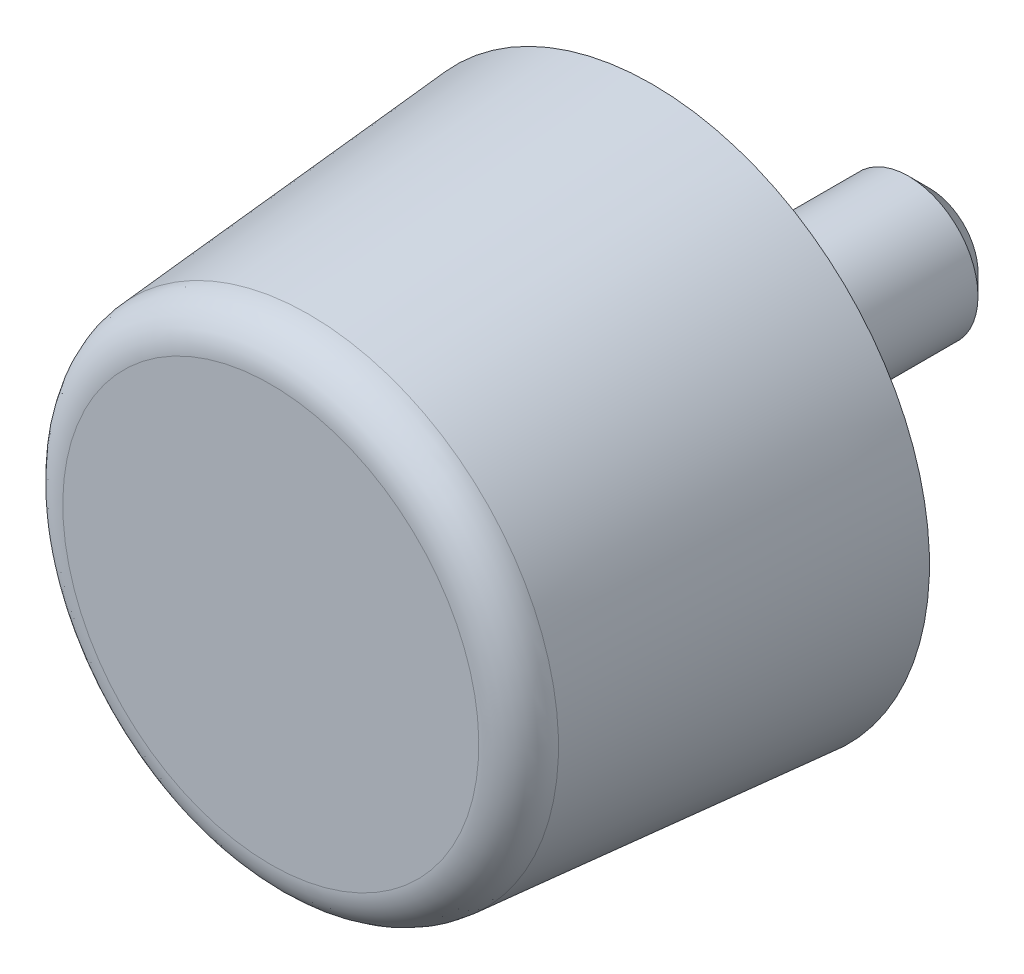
ISO-10303-21;
HEADER;
FILE_DESCRIPTION(('STEP AP214'),'2;1');
FILE_NAME('part.step','',(''),(''),'','','');
FILE_SCHEMA(('AUTOMOTIVE_DESIGN { 1 0 10303 214 1 1 1 1 }'));
ENDSEC;
DATA;
#1=APPLICATION_CONTEXT('core data for automotive mechanical design processes');
#2=APPLICATION_PROTOCOL_DEFINITION('international standard','automotive_design',2000,#1);
#3=PRODUCT_CONTEXT('',#1,'mechanical');
#4=PRODUCT('Part','Part','',(#3));
#5=PRODUCT_RELATED_PRODUCT_CATEGORY('part','',(#4));
#6=PRODUCT_DEFINITION_FORMATION('','',#4);
#7=PRODUCT_DEFINITION_CONTEXT('part definition',#1,'design');
#8=PRODUCT_DEFINITION('design','',#6,#7);
#9=PRODUCT_DEFINITION_SHAPE('','',#8);
#10=(LENGTH_UNIT() NAMED_UNIT(*) SI_UNIT(.MILLI.,.METRE.));
#11=(NAMED_UNIT(*) PLANE_ANGLE_UNIT() SI_UNIT($,.RADIAN.));
#12=(NAMED_UNIT(*) SI_UNIT($,.STERADIAN.) SOLID_ANGLE_UNIT());
#13=UNCERTAINTY_MEASURE_WITH_UNIT(LENGTH_MEASURE(1.E-05),#10,'distance_accuracy_value','');
#14=(GEOMETRIC_REPRESENTATION_CONTEXT(3) GLOBAL_UNCERTAINTY_ASSIGNED_CONTEXT((#13)) GLOBAL_UNIT_ASSIGNED_CONTEXT((#10,
#11,#12)) REPRESENTATION_CONTEXT('',''));
#15=CARTESIAN_POINT('',(0.,0.,0.));
#16=DIRECTION('',(0.,0.,1.));
#17=DIRECTION('',(1.,0.,0.));
#18=AXIS2_PLACEMENT_3D('',#15,#16,#17);
#19=CARTESIAN_POINT('',(0.,0.,22.));
#20=DIRECTION('',(0.,0.,1.));
#21=DIRECTION('',(0.,-1.,0.));
#22=AXIS2_PLACEMENT_3D('',#19,#20,#21);
#23=CYLINDRICAL_SURFACE('',#22,14.4);
#24=CARTESIAN_POINT('',(0.,0.,0.));
#25=DIRECTION('',(0.,0.,1.));
#26=DIRECTION('',(0.,-1.,0.));
#27=AXIS2_PLACEMENT_3D('',#24,#25,#26);
#28=CIRCLE('',#27,14.4);
#29=CARTESIAN_POINT('',(0.,-14.4,0.));
#30=VERTEX_POINT('',#29);
#31=EDGE_CURVE('E27',#30,#30,#28,.T.);
#32=ORIENTED_EDGE('',*,*,#31,.F.);
#33=EDGE_LOOP('',(#32));
#34=FACE_BOUND('',#33,.T.);
#35=CARTESIAN_POINT('',(0.,0.,0.049999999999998));
#36=DIRECTION('',(0.,0.,1.));
#37=DIRECTION('',(0.,-1.,0.));
#38=AXIS2_PLACEMENT_3D('',#35,#36,#37);
#39=CIRCLE('',#38,14.4);
#40=CARTESIAN_POINT('',(0.,-14.4,0.049999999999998));
#41=VERTEX_POINT('',#40);
#42=EDGE_CURVE('E44',#41,#41,#39,.T.);
#43=ORIENTED_EDGE('',*,*,#42,.T.);
#44=EDGE_LOOP('',(#43));
#45=FACE_BOUND('',#44,.T.);
#46=ADVANCED_FACE('F12',(#34,#45),#23,.F.);
#47=CARTESIAN_POINT('',(14.4,0.,0.));
#48=DIRECTION('',(0.,0.,1.));
#49=DIRECTION('',(0.,-1.,0.));
#50=AXIS2_PLACEMENT_3D('',#47,#48,#49);
#51=PLANE('',#50);
#52=CARTESIAN_POINT('',(0.,0.,0.));
#53=DIRECTION('',(0.,0.,1.));
#54=DIRECTION('',(0.,-1.,0.));
#55=AXIS2_PLACEMENT_3D('',#52,#53,#54);
#56=CIRCLE('',#55,16.);
#57=CARTESIAN_POINT('',(0.,-16.,0.));
#58=VERTEX_POINT('',#57);
#59=EDGE_CURVE('E32',#58,#58,#56,.T.);
#60=ORIENTED_EDGE('',*,*,#59,.F.);
#61=EDGE_LOOP('',(#60));
#62=FACE_BOUND('',#61,.T.);
#63=ORIENTED_EDGE('',*,*,#31,.T.);
#64=EDGE_LOOP('',(#63));
#65=FACE_BOUND('',#64,.T.);
#66=ADVANCED_FACE('F72',(#62,#65),#51,.F.);
#67=CARTESIAN_POINT('',(0.,0.,0.));
#68=DIRECTION('',(0.,0.,-1.));
#69=DIRECTION('',(0.,1.,0.));
#70=AXIS2_PLACEMENT_3D('',#67,#68,#69);
#71=CONICAL_SURFACE('',#70,16.,0.0810513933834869);
#72=CARTESIAN_POINT('',(0.,0.,19.7943104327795));
#73=DIRECTION('',(0.,0.,1.));
#74=DIRECTION('',(0.,-1.,0.));
#75=AXIS2_PLACEMENT_3D('',#72,#73,#74);
#76=CIRCLE('',#75,14.3921211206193);
#77=CARTESIAN_POINT('',(0.,-14.3921211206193,19.7943104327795));
#78=VERTEX_POINT('',#77);
#79=EDGE_CURVE('E35',#78,#78,#76,.T.);
#80=ORIENTED_EDGE('',*,*,#79,.F.);
#81=EDGE_LOOP('',(#80));
#82=FACE_BOUND('',#81,.T.);
#83=ORIENTED_EDGE('',*,*,#59,.T.);
#84=EDGE_LOOP('',(#83));
#85=FACE_BOUND('',#84,.T.);
#86=ADVANCED_FACE('F77',(#82,#85),#71,.T.);
#87=CARTESIAN_POINT('',(0.,0.,19.6));
#88=DIRECTION('',(0.,0.,1.));
#89=DIRECTION('',(0.,-1.,0.));
#90=AXIS2_PLACEMENT_3D('',#87,#88,#89);
#91=TOROIDAL_SURFACE('',#90,12.,2.4);
#92=ORIENTED_EDGE('',*,*,#79,.T.);
#93=EDGE_LOOP('',(#92));
#94=FACE_BOUND('',#93,.T.);
#95=CARTESIAN_POINT('',(0.,0.,22.));
#96=DIRECTION('',(0.,0.,1.));
#97=DIRECTION('',(0.,-1.,0.));
#98=AXIS2_PLACEMENT_3D('',#95,#96,#97);
#99=CIRCLE('',#98,12.);
#100=CARTESIAN_POINT('',(0.,-12.,22.));
#101=VERTEX_POINT('',#100);
#102=EDGE_CURVE('E38',#101,#101,#99,.T.);
#103=ORIENTED_EDGE('',*,*,#102,.F.);
#104=EDGE_LOOP('',(#103));
#105=FACE_BOUND('',#104,.T.);
#106=ADVANCED_FACE('F84',(#94,#105),#91,.T.);
#107=CARTESIAN_POINT('',(12.,0.,22.));
#108=DIRECTION('',(0.,0.,-1.));
#109=DIRECTION('',(0.,1.,0.));
#110=AXIS2_PLACEMENT_3D('',#107,#108,#109);
#111=PLANE('',#110);
#112=ORIENTED_EDGE('',*,*,#102,.T.);
#113=EDGE_LOOP('',(#112));
#114=FACE_BOUND('',#113,.T.);
#115=ADVANCED_FACE('F59',(#114),#111,.F.);
#116=CARTESIAN_POINT('',(0.,0.,0.));
#117=DIRECTION('',(0.,0.,1.));
#118=DIRECTION('',(0.,-1.,0.));
#119=AXIS2_PLACEMENT_3D('',#116,#117,#118);
#120=PLANE('',#119);
#121=CARTESIAN_POINT('',(0.,0.,0.));
#122=DIRECTION('',(0.,0.,1.));
#123=DIRECTION('',(0.,-1.,0.));
#124=AXIS2_PLACEMENT_3D('',#121,#122,#123);
#125=CIRCLE('',#124,14.35);
#126=CARTESIAN_POINT('',(0.,-14.35,0.));
#127=VERTEX_POINT('',#126);
#128=EDGE_CURVE('E41',#127,#127,#125,.T.);
#129=ORIENTED_EDGE('',*,*,#128,.F.);
#130=EDGE_LOOP('',(#129));
#131=FACE_BOUND('',#130,.T.);
#132=CARTESIAN_POINT('',(0.,0.,0.));
#133=DIRECTION('',(0.,0.,1.));
#134=DIRECTION('',(0.,-1.,0.));
#135=AXIS2_PLACEMENT_3D('',#132,#133,#134);
#136=CIRCLE('',#135,4.);
#137=CARTESIAN_POINT('',(0.,-4.,0.));
#138=VERTEX_POINT('',#137);
#139=EDGE_CURVE('E23',#138,#138,#136,.T.);
#140=ORIENTED_EDGE('',*,*,#139,.T.);
#141=EDGE_LOOP('',(#140));
#142=FACE_BOUND('',#141,.T.);
#143=ADVANCED_FACE('F53',(#131,#142),#120,.F.);
#144=CARTESIAN_POINT('',(0.,0.,0.));
#145=DIRECTION('',(0.,0.,1.));
#146=DIRECTION('',(0.,-1.,0.));
#147=AXIS2_PLACEMENT_3D('',#144,#145,#146);
#148=CONICAL_SURFACE('',#147,14.35,0.785398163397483);
#149=ORIENTED_EDGE('',*,*,#42,.F.);
#150=EDGE_LOOP('',(#149));
#151=FACE_BOUND('',#150,.T.);
#152=ORIENTED_EDGE('',*,*,#128,.T.);
#153=EDGE_LOOP('',(#152));
#154=FACE_BOUND('',#153,.T.);
#155=ADVANCED_FACE('F49',(#151,#154),#148,.T.);
#156=CARTESIAN_POINT('',(0.,0.,22.));
#157=DIRECTION('',(0.,0.,1.));
#158=DIRECTION('',(0.,-1.,0.));
#159=AXIS2_PLACEMENT_3D('',#156,#157,#158);
#160=CYLINDRICAL_SURFACE('',#159,4.);
#161=CARTESIAN_POINT('',(0.,0.,-14.8));
#162=DIRECTION('',(0.,0.,-1.));
#163=DIRECTION('',(0.,1.,0.));
#164=AXIS2_PLACEMENT_3D('',#161,#162,#163);
#165=CIRCLE('',#164,4.);
#166=CARTESIAN_POINT('',(0.,4.,-14.8));
#167=VERTEX_POINT('',#166);
#168=EDGE_CURVE('E8',#167,#167,#165,.F.);
#169=ORIENTED_EDGE('',*,*,#168,.T.);
#170=EDGE_LOOP('',(#169));
#171=FACE_BOUND('',#170,.T.);
#172=ORIENTED_EDGE('',*,*,#139,.F.);
#173=EDGE_LOOP('',(#172));
#174=FACE_BOUND('',#173,.T.);
#175=ADVANCED_FACE('F52',(#171,#174),#160,.T.);
#176=CARTESIAN_POINT('',(0.,0.,-16.));
#177=DIRECTION('',(0.,0.,-1.));
#178=DIRECTION('',(0.,1.,0.));
#179=AXIS2_PLACEMENT_3D('',#176,#177,#178);
#180=PLANE('',#179);
#181=CARTESIAN_POINT('',(0.,0.,-16.));
#182=DIRECTION('',(0.,0.,-1.));
#183=DIRECTION('',(0.,1.,0.));
#184=AXIS2_PLACEMENT_3D('',#181,#182,#183);
#185=CIRCLE('',#184,2.8);
#186=CARTESIAN_POINT('',(0.,2.8,-16.));
#187=VERTEX_POINT('',#186);
#188=EDGE_CURVE('E19',#187,#187,#185,.T.);
#189=ORIENTED_EDGE('',*,*,#188,.T.);
#190=EDGE_LOOP('',(#189));
#191=FACE_BOUND('',#190,.T.);
#192=ADVANCED_FACE('F64',(#191),#180,.T.);
#193=CARTESIAN_POINT('',(0.,0.,-16.));
#194=DIRECTION('',(0.,0.,1.));
#195=DIRECTION('',(0.,-1.,0.));
#196=AXIS2_PLACEMENT_3D('',#193,#194,#195);
#197=CONICAL_SURFACE('',#196,2.8,0.785398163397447);
#198=ORIENTED_EDGE('',*,*,#168,.F.);
#199=EDGE_LOOP('',(#198));
#200=FACE_BOUND('',#199,.T.);
#201=ORIENTED_EDGE('',*,*,#188,.F.);
#202=EDGE_LOOP('',(#201));
#203=FACE_BOUND('',#202,.T.);
#204=ADVANCED_FACE('F14',(#200,#203),#197,.T.);
#205=CLOSED_SHELL('',(#46,#66,#86,#106,#115,#143,#155,#175,#192,#204));
#206=MANIFOLD_SOLID_BREP('B1',#205);
#207=ADVANCED_BREP_SHAPE_REPRESENTATION('',(#18,#206),#14);
#208=SHAPE_DEFINITION_REPRESENTATION(#9,#207);
ENDSEC;
END-ISO-10303-21;
